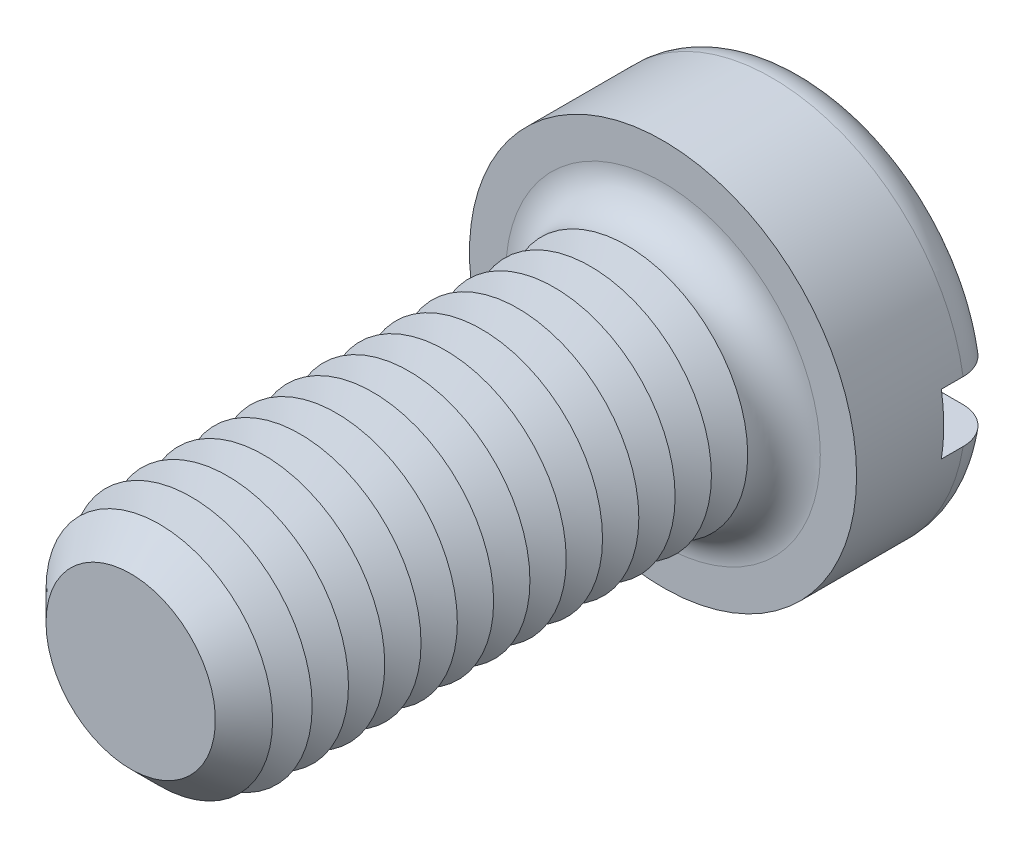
from build123d import *

# Parameters (mm, degrees)
SKETCH3_R           = 8
BOSS_EXTRUDE2_DEPTH = 6
SKETCH4_R           = 5
BOSS_EXTRUDE3_DEPTH = 22
FILLET1_R           = 1.5
CHAMFER1_SIZE       = 1.5
LPATTERN1_COUNT     = 13
LPATTERN1_PITCH     = 1.5
SKETCH8_W           = 16
SKETCH8_H           = 2.5
CUT_EXTRUDE1_DEPTH  = 2.4


with BuildPart() as part:
    # Sketch3 → Boss-Extrude2 (new body)
    with BuildSketch(Plane.XY):
        Circle(SKETCH3_R)
    extrude(amount=-BOSS_EXTRUDE2_DEPTH)

    # Sketch4 → Boss-Extrude3 (add)
    with BuildSketch(Plane.XY):
        Circle(SKETCH4_R)
    extrude(amount=BOSS_EXTRUDE3_DEPTH)

    # Fillet1
    fillet1_edges = [part.edges().sort_by_distance(p)[0] for p in [
        (-8, 0, -6),
        (-5, 0, 0),
    ]]
    fillet(fillet1_edges, radius=FILLET1_R)

    # Chamfer1
    chamfer1_edges = [part.edges().sort_by_distance(p)[0] for p in [
        (-5, 0, 22),
    ]]
    chamfer(chamfer1_edges, length=CHAMFER1_SIZE)

    # Sketch6 → Cut-Revolve1 (revolve, cut)
    with BuildSketch(Plane(origin=(0, 0, 0), x_dir=(0, 0, -1), z_dir=(1, 0, 0)), mode=Mode.PRIVATE) as cut_revolve1_sk:
        Polygon((-1.5, 5), (-2.25, 3.700961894), (-3, 5), align=None)
    cut_revolve1 = revolve(cut_revolve1_sk.sketch.rotate(Axis((0, 0, -1.694361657), (0, 0, 1)), 90), axis=Axis((0, 0, -1.694361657), (0, 0, 1)), mode=Mode.SUBTRACT)

    # LPattern1: Cut-Revolve1 ×13
    with Locations(*[(0, 0, i * LPATTERN1_PITCH) for i in range(1, LPATTERN1_COUNT)]):
        add(cut_revolve1, mode=Mode.SUBTRACT)

    # Sketch8 → Cut-Extrude1 (cut)
    with BuildSketch(Plane(origin=(0, 0, -6), x_dir=(-1, 0, 0), z_dir=(0, 0, -1))):
        Rectangle(SKETCH8_W, SKETCH8_H)
    extrude(amount=-CUT_EXTRUDE1_DEPTH, mode=Mode.SUBTRACT)


solid = part.part
